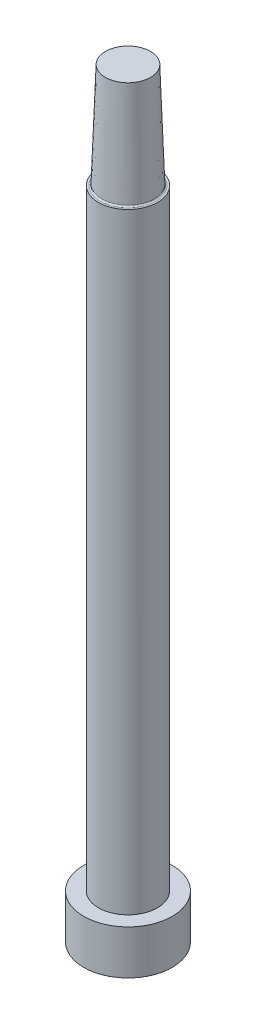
ISO-10303-21;
HEADER;
FILE_DESCRIPTION(('STEP AP214'),'2;1');
FILE_NAME('part.step','',(''),(''),'','','');
FILE_SCHEMA(('AUTOMOTIVE_DESIGN { 1 0 10303 214 1 1 1 1 }'));
ENDSEC;
DATA;
#1=APPLICATION_CONTEXT('core data for automotive mechanical design processes');
#2=APPLICATION_PROTOCOL_DEFINITION('international standard','automotive_design',2000,#1);
#3=PRODUCT_CONTEXT('',#1,'mechanical');
#4=PRODUCT('Part','Part','',(#3));
#5=PRODUCT_RELATED_PRODUCT_CATEGORY('part','',(#4));
#6=PRODUCT_DEFINITION_FORMATION('','',#4);
#7=PRODUCT_DEFINITION_CONTEXT('part definition',#1,'design');
#8=PRODUCT_DEFINITION('design','',#6,#7);
#9=PRODUCT_DEFINITION_SHAPE('','',#8);
#10=(LENGTH_UNIT() NAMED_UNIT(*) SI_UNIT(.MILLI.,.METRE.));
#11=(NAMED_UNIT(*) PLANE_ANGLE_UNIT() SI_UNIT($,.RADIAN.));
#12=(NAMED_UNIT(*) SI_UNIT($,.STERADIAN.) SOLID_ANGLE_UNIT());
#13=UNCERTAINTY_MEASURE_WITH_UNIT(LENGTH_MEASURE(1.E-05),#10,'distance_accuracy_value','');
#14=(GEOMETRIC_REPRESENTATION_CONTEXT(3) GLOBAL_UNCERTAINTY_ASSIGNED_CONTEXT((#13)) GLOBAL_UNIT_ASSIGNED_CONTEXT((#10,
#11,#12)) REPRESENTATION_CONTEXT('',''));
#15=CARTESIAN_POINT('',(0.,0.,0.));
#16=DIRECTION('',(0.,0.,1.));
#17=DIRECTION('',(1.,0.,0.));
#18=AXIS2_PLACEMENT_3D('',#15,#16,#17);
#19=CARTESIAN_POINT('',(0.,49.4323076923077,0.));
#20=DIRECTION('',(0.,1.,0.));
#21=DIRECTION('',(0.,0.,1.));
#22=AXIS2_PLACEMENT_3D('',#19,#20,#21);
#23=CYLINDRICAL_SURFACE('',#22,3.99999999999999);
#24=CARTESIAN_POINT('',(0.,6.,0.));
#25=DIRECTION('',(0.,1.,0.));
#26=DIRECTION('',(0.,0.,1.));
#27=AXIS2_PLACEMENT_3D('',#24,#25,#26);
#28=CIRCLE('',#27,3.99999999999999);
#29=CARTESIAN_POINT('',(0.,6.,3.99999999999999));
#30=VERTEX_POINT('',#29);
#31=EDGE_CURVE('E42',#30,#30,#28,.T.);
#32=ORIENTED_EDGE('',*,*,#31,.T.);
#33=EDGE_LOOP('',(#32));
#34=FACE_BOUND('',#33,.T.);
#35=CARTESIAN_POINT('',(0.,88.85,0.));
#36=DIRECTION('',(0.,1.,0.));
#37=DIRECTION('',(-1.,0.,0.));
#38=AXIS2_PLACEMENT_3D('',#35,#36,#37);
#39=CIRCLE('',#38,3.99999999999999);
#40=CARTESIAN_POINT('',(-3.99999999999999,88.85,0.));
#41=VERTEX_POINT('',#40);
#42=EDGE_CURVE('E34',#41,#41,#39,.F.);
#43=ORIENTED_EDGE('',*,*,#42,.T.);
#44=EDGE_LOOP('',(#43));
#45=FACE_BOUND('',#44,.T.);
#46=ADVANCED_FACE('F30',(#34,#45),#23,.T.);
#47=CARTESIAN_POINT('',(0.,0.,0.));
#48=DIRECTION('',(0.,-1.,0.));
#49=DIRECTION('',(0.,0.,-1.));
#50=AXIS2_PLACEMENT_3D('',#47,#48,#49);
#51=PLANE('',#50);
#52=CARTESIAN_POINT('',(0.,0.,0.));
#53=DIRECTION('',(0.,1.,0.));
#54=DIRECTION('',(0.,0.,1.));
#55=AXIS2_PLACEMENT_3D('',#52,#53,#54);
#56=CIRCLE('',#55,5.99999999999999);
#57=CARTESIAN_POINT('',(0.,0.,5.99999999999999));
#58=VERTEX_POINT('',#57);
#59=EDGE_CURVE('E10',#58,#58,#56,.T.);
#60=ORIENTED_EDGE('',*,*,#59,.F.);
#61=EDGE_LOOP('',(#60));
#62=FACE_BOUND('',#61,.T.);
#63=ADVANCED_FACE('F32',(#62),#51,.T.);
#64=CARTESIAN_POINT('',(0.,49.4323076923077,0.));
#65=DIRECTION('',(0.,1.,0.));
#66=DIRECTION('',(0.,0.,1.));
#67=AXIS2_PLACEMENT_3D('',#64,#65,#66);
#68=CYLINDRICAL_SURFACE('',#67,5.99999999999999);
#69=ORIENTED_EDGE('',*,*,#59,.T.);
#70=EDGE_LOOP('',(#69));
#71=FACE_BOUND('',#70,.T.);
#72=CARTESIAN_POINT('',(0.,6.,0.));
#73=DIRECTION('',(0.,1.,0.));
#74=DIRECTION('',(0.,0.,1.));
#75=AXIS2_PLACEMENT_3D('',#72,#73,#74);
#76=CIRCLE('',#75,5.99999999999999);
#77=CARTESIAN_POINT('',(0.,6.,5.99999999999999));
#78=VERTEX_POINT('',#77);
#79=EDGE_CURVE('E38',#78,#78,#76,.T.);
#80=ORIENTED_EDGE('',*,*,#79,.F.);
#81=EDGE_LOOP('',(#80));
#82=FACE_BOUND('',#81,.T.);
#83=ADVANCED_FACE('F76',(#71,#82),#68,.T.);
#84=CARTESIAN_POINT('',(-5.99999999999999,6.,0.));
#85=DIRECTION('',(0.,1.,0.));
#86=DIRECTION('',(0.,0.,1.));
#87=AXIS2_PLACEMENT_3D('',#84,#85,#86);
#88=PLANE('',#87);
#89=ORIENTED_EDGE('',*,*,#79,.T.);
#90=EDGE_LOOP('',(#89));
#91=FACE_BOUND('',#90,.T.);
#92=ORIENTED_EDGE('',*,*,#31,.F.);
#93=EDGE_LOOP('',(#92));
#94=FACE_BOUND('',#93,.T.);
#95=ADVANCED_FACE('F81',(#91,#94),#88,.T.);
#96=CARTESIAN_POINT('',(0.,88.85,0.));
#97=DIRECTION('',(0.,1.,0.));
#98=DIRECTION('',(1.,0.,0.));
#99=AXIS2_PLACEMENT_3D('',#96,#97,#98);
#100=PLANE('',#99);
#101=ORIENTED_EDGE('',*,*,#42,.F.);
#102=EDGE_LOOP('',(#101));
#103=FACE_BOUND('',#102,.T.);
#104=CARTESIAN_POINT('',(0.,88.85,0.));
#105=DIRECTION('',(0.,1.,0.));
#106=DIRECTION('',(1.,0.,0.));
#107=AXIS2_PLACEMENT_3D('',#104,#105,#106);
#108=CIRCLE('',#107,3.74853482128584);
#109=CARTESIAN_POINT('',(3.74853482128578,88.85,0.));
#110=VERTEX_POINT('',#109);
#111=EDGE_CURVE('E47',#110,#110,#108,.T.);
#112=ORIENTED_EDGE('',*,*,#111,.F.);
#113=EDGE_LOOP('',(#112));
#114=FACE_BOUND('',#113,.T.);
#115=ADVANCED_FACE('F83',(#103,#114),#100,.T.);
#116=CARTESIAN_POINT('',(0.,88.85,0.));
#117=DIRECTION('',(0.,-1.,0.));
#118=DIRECTION('',(-1.,0.,0.));
#119=AXIS2_PLACEMENT_3D('',#116,#117,#118);
#120=CONICAL_SURFACE('',#119,3.5525,0.0349065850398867);
#121=CARTESIAN_POINT('',(0.,103.061854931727,0.));
#122=DIRECTION('',(0.,-1.,0.));
#123=DIRECTION('',(1.,0.,0.));
#124=AXIS2_PLACEMENT_3D('',#121,#122,#123);
#125=CIRCLE('',#124,3.05621108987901);
#126=CARTESIAN_POINT('',(3.05621108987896,103.061854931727,0.));
#127=VERTEX_POINT('',#126);
#128=EDGE_CURVE('E53',#127,#127,#125,.T.);
#129=ORIENTED_EDGE('',*,*,#128,.T.);
#130=EDGE_LOOP('',(#129));
#131=FACE_BOUND('',#130,.T.);
#132=CARTESIAN_POINT('',(0.,89.0459154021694,0.));
#133=DIRECTION('',(0.,1.,0.));
#134=DIRECTION('',(1.,0.,0.));
#135=AXIS2_PLACEMENT_3D('',#132,#133,#134);
#136=CIRCLE('',#135,3.54565848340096);
#137=CARTESIAN_POINT('',(3.54565848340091,89.0459154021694,0.));
#138=VERTEX_POINT('',#137);
#139=EDGE_CURVE('E50',#138,#138,#136,.F.);
#140=ORIENTED_EDGE('',*,*,#139,.F.);
#141=EDGE_LOOP('',(#140));
#142=FACE_BOUND('',#141,.T.);
#143=ADVANCED_FACE('F57',(#131,#142),#120,.T.);
#144=CARTESIAN_POINT('',(0.,89.053,0.));
#145=DIRECTION('',(0.,1.,0.));
#146=DIRECTION('',(1.,0.,0.));
#147=AXIS2_PLACEMENT_3D('',#144,#145,#146);
#148=TOROIDAL_SURFACE('',#147,3.74853482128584,0.203);
#149=ORIENTED_EDGE('',*,*,#111,.T.);
#150=EDGE_LOOP('',(#149));
#151=FACE_BOUND('',#150,.T.);
#152=ORIENTED_EDGE('',*,*,#139,.T.);
#153=EDGE_LOOP('',(#152));
#154=FACE_BOUND('',#153,.T.);
#155=ADVANCED_FACE('F62',(#151,#154),#148,.F.);
#156=CARTESIAN_POINT('',(0.,103.061854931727,0.));
#157=DIRECTION('',(0.,-1.,0.));
#158=DIRECTION('',(1.,0.,0.));
#159=AXIS2_PLACEMENT_3D('',#156,#157,#158);
#160=PLANE('',#159);
#161=ORIENTED_EDGE('',*,*,#128,.F.);
#162=EDGE_LOOP('',(#161));
#163=FACE_BOUND('',#162,.T.);
#164=ADVANCED_FACE('F60',(#163),#160,.F.);
#165=CLOSED_SHELL('',(#46,#63,#83,#95,#115,#143,#155,#164));
#166=MANIFOLD_SOLID_BREP('B2',#165);
#167=ADVANCED_BREP_SHAPE_REPRESENTATION('',(#18,#166),#14);
#168=SHAPE_DEFINITION_REPRESENTATION(#9,#167);
ENDSEC;
END-ISO-10303-21;
